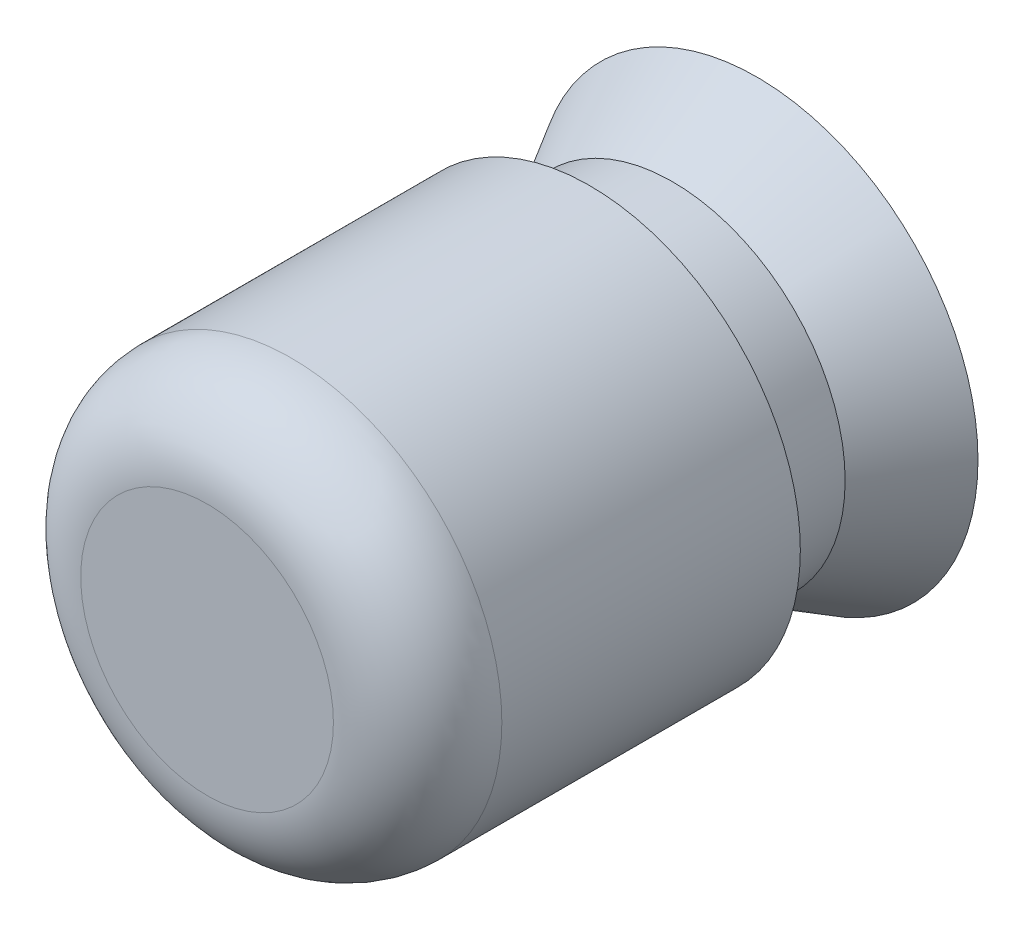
from build123d import *


with BuildPart() as part:
    # Sketch 1 → Revolve 1 (revolve)
    with BuildSketch(Plane(origin=(0, 0, 0), x_dir=(0, 0, -1), z_dir=(1, 0, 0)), mode=Mode.PRIVATE) as revolve_1_sk:
        with BuildLine():
            Line((0, 0), (0, 1.190625))
            ThreePointArc((0, 1.190625), (0.232483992, 1.751891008), (0.79375, 1.984375))
            Line((0.79375, 1.984375), (3.6068, 1.984375))
            Line((3.6068, 1.984375), (3.6068, 1.6256))
            Line((3.6068, 1.6256), (4.38785, 1.6256))
            Line((4.38785, 1.6256), (5.1816, 2.083871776))
            Line((5.1816, 2.083871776), (5.1816, 0))
            Line((5.1816, 0), (0, 0))
        make_face()
    revolve(revolve_1_sk.sketch.rotate(Axis((0, 0, 0), (0, 0, -1)), 90), axis=Axis((0, 0, 0), (0, 0, -1)))


solid = part.part
